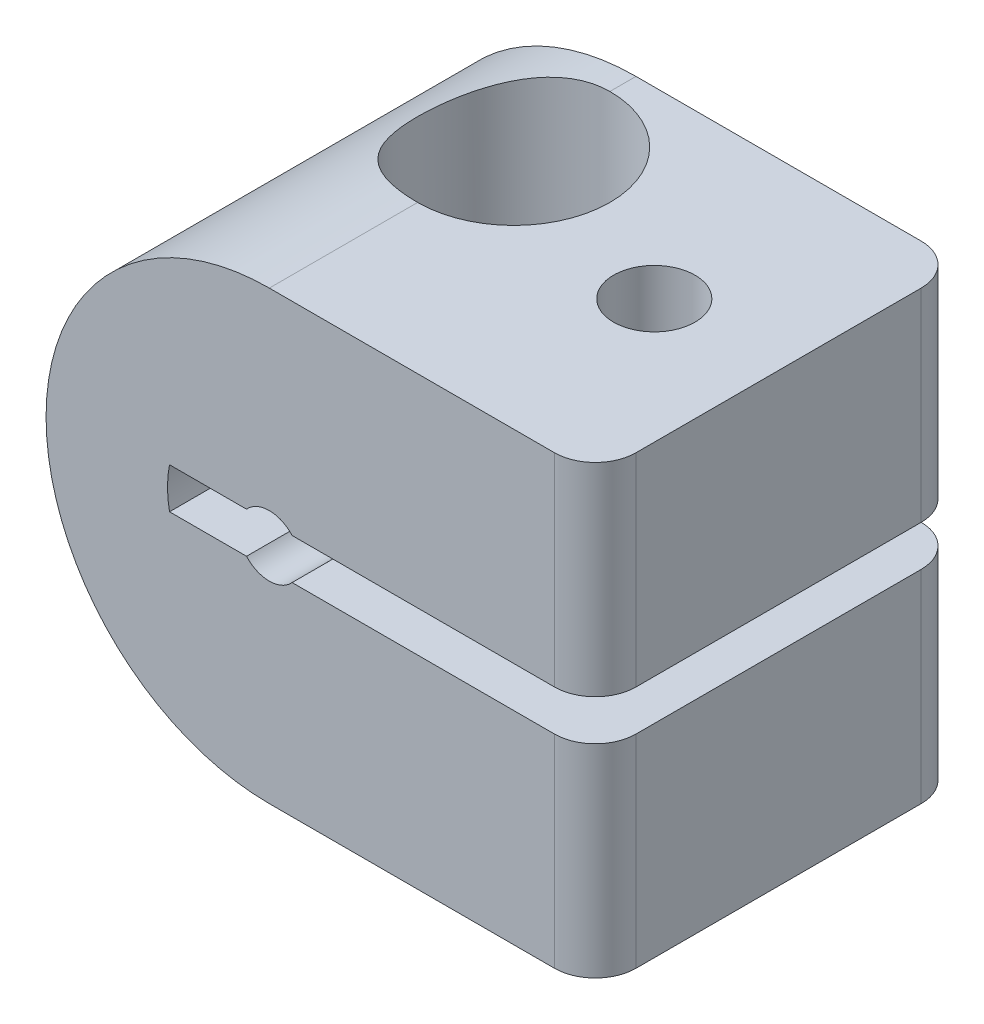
from build123d import *

# Parameters (mm, degrees)
BOSS_EXTRUDE1_DEPTH     = 5.08
SKETCH6_R               = 0.9525
CUT_EXTRUDE4_DEPTH      = 8.89
BOSS_EXTRUDE2_START     = 6.35
BOSS_EXTRUDE2_DEPTH     = 6.35
SKETCH7_R               = 3.175
CUT_EXTRUDE5_DEPTH      = 7.62
FILLET1_R               = 1.27
CUT_EXTRUDE2_DEPTH      = 17.801980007
SKETCH5_R               = 1.27
CUT_EXTRUDE3_DEPTH      = 19.36551738
CUT_EXTRUDE6_REACH      = 20.366
CUT_EXTRUDE6_END_RADIUS = 3.175
SKETCH8_R               = 2.9972


with BuildPart() as part:
    # Sketch1 → Boss-Extrude1 (new body)
    with BuildSketch(Plane.XY):
        with BuildLine():
            Line((0, 6.9596), (10.16, 6.9596))
            Line((10.16, 6.9596), (10.16, -6.9596))
            Line((10.16, -6.9596), (0, -6.9596))
            ThreePointArc((0, -6.9596), (-6.9596, 0), (0, 6.9596))
        make_face()
    extrude(amount=BOSS_EXTRUDE1_DEPTH)

    # Sketch6 → Cut-Extrude4 (cut)
    with BuildSketch(Plane.XY.offset(5.08)):
        Circle(SKETCH6_R)
    extrude(amount=-CUT_EXTRUDE4_DEPTH, mode=Mode.SUBTRACT)

    # Sketch2 → Boss-Extrude2 (add)
    with BuildSketch(Plane(origin=(0, 0, 0), x_dir=(-1, 0, 0), z_dir=(0, 0, -1)).offset(BOSS_EXTRUDE2_START)):
        with BuildLine():
            Line((-10.16, 6.9596), (0, 6.9596))
            ThreePointArc((0, 6.9596), (6.9596, 0), (0, -6.9596))
            Line((0, -6.9596), (-10.16, -6.9596))
            Line((-10.16, -6.9596), (-10.16, 6.9596))
        make_face()
    extrude(amount=-BOSS_EXTRUDE2_DEPTH)

    # Sketch7 → Cut-Extrude5 (cut)
    with BuildSketch(Plane.XY.offset(-6.35)):
        with Locations(Location((0, 0, 0), (0, 0, 180))):
            Circle(SKETCH7_R)
    extrude(amount=CUT_EXTRUDE5_DEPTH, mode=Mode.SUBTRACT)

    # Fillet1
    fillet1_edges = [part.edges().sort_by_distance(p)[0] for p in [
        (10.16, 0, 5.08),
        (10.16, 0, -6.35),
    ]]
    fillet(fillet1_edges, radius=FILLET1_R)

    # Sketch4 → Cut-Extrude2 (cut, through all)
    with BuildSketch(Plane.XY.offset(-6.35)):
        with BuildLine():
            Line((10.16, 0.635), (-3.110851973, 0.635))
            ThreePointArc((-3.110851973, 0.635), (-3.175, 0), (-3.110851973, -0.635))
            Line((-3.110851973, -0.635), (10.16, -0.635))
            Line((10.16, -0.635), (10.16, 0.635))
        make_face()
    extrude(amount=CUT_EXTRUDE2_DEPTH, mode=Mode.SUBTRACT)

    # Sketch5 → Cut-Extrude3 (cut, through all)
    with BuildSketch(Plane(origin=(0, 6.9596, 0), x_dir=(1, 0, 0), z_dir=(0, 1, 0))):
        with Locations(Location((6.285851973, 0.635, 0), (0, 0, 270))):
            Circle(SKETCH5_R)
    extrude(amount=-CUT_EXTRUDE3_DEPTH, mode=Mode.SUBTRACT)

    # Cut-Extrude6: up to this cylinder (the profile starts outside it)
    cut_extrude6_end = Plane(origin=(0, 0, -2.54), z_dir=(0, 0, -1)) * Cylinder(CUT_EXTRUDE6_END_RADIUS, 48.082, mode=Mode.PRIVATE)
    # Sketch8 → Cut-Extrude6 (cut, up to the surface)
    with BuildSketch(Plane(origin=(0, 6.9596, 0), x_dir=(1, 0, 0), z_dir=(0, 1, 0)), mode=Mode.PRIVATE) as cut_extrude6_sk1:
        with Locations(Location((0, 2.54, 0), (0, 0, 270))):
            Circle(SKETCH8_R)
    cut_extrude6_tool1 = extrude(cut_extrude6_sk1.sketch, amount=-CUT_EXTRUDE6_REACH, mode=Mode.PRIVATE) - cut_extrude6_end
    add(cut_extrude6_tool1.solids().sort_by_distance((0, 6.9596, -2.54))[0], mode=Mode.SUBTRACT)


solid = part.part
